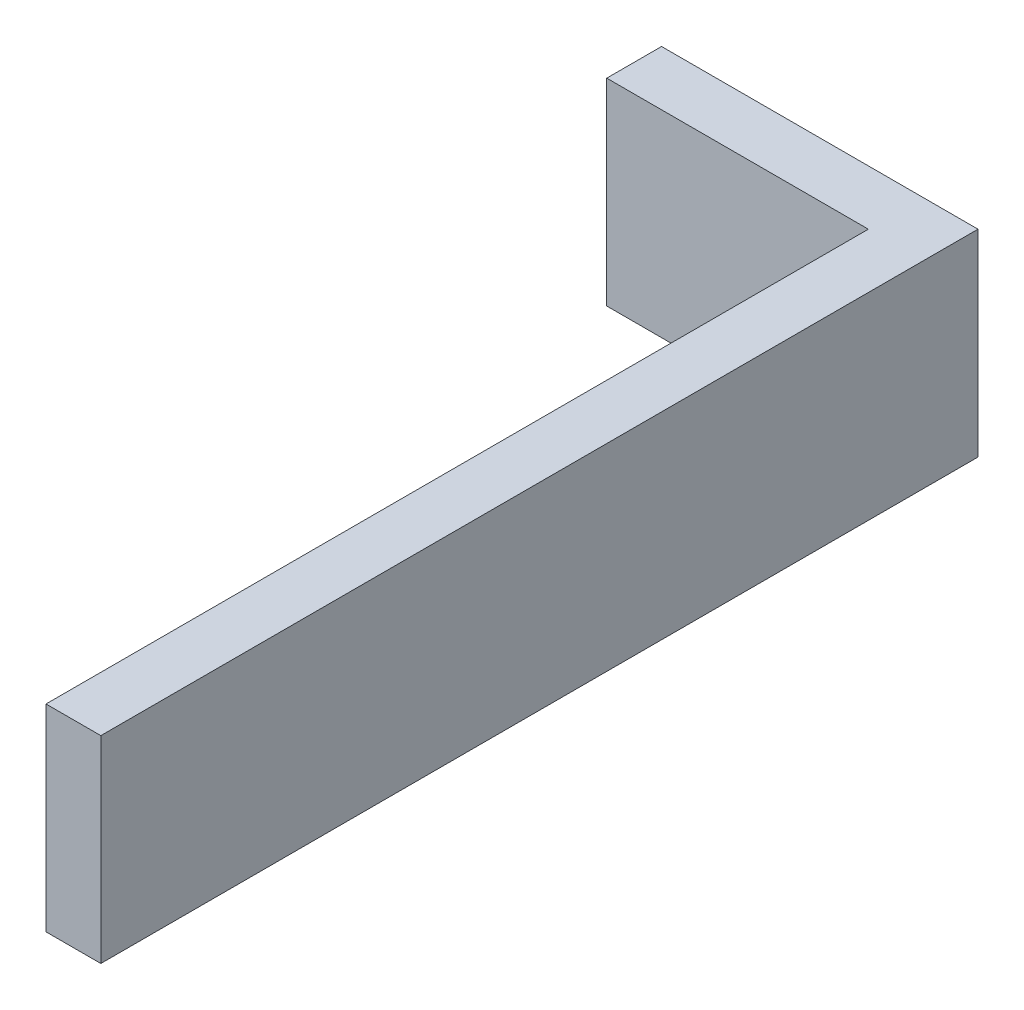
ISO-10303-21;
HEADER;
FILE_DESCRIPTION(('STEP AP214'),'2;1');
FILE_NAME('part.step','',(''),(''),'','','');
FILE_SCHEMA(('AUTOMOTIVE_DESIGN { 1 0 10303 214 1 1 1 1 }'));
ENDSEC;
DATA;
#1=APPLICATION_CONTEXT('core data for automotive mechanical design processes');
#2=APPLICATION_PROTOCOL_DEFINITION('international standard','automotive_design',2000,#1);
#3=PRODUCT_CONTEXT('',#1,'mechanical');
#4=PRODUCT('Part','Part','',(#3));
#5=PRODUCT_RELATED_PRODUCT_CATEGORY('part','',(#4));
#6=PRODUCT_DEFINITION_FORMATION('','',#4);
#7=PRODUCT_DEFINITION_CONTEXT('part definition',#1,'design');
#8=PRODUCT_DEFINITION('design','',#6,#7);
#9=PRODUCT_DEFINITION_SHAPE('','',#8);
#10=(LENGTH_UNIT() NAMED_UNIT(*) SI_UNIT(.MILLI.,.METRE.));
#11=(NAMED_UNIT(*) PLANE_ANGLE_UNIT() SI_UNIT($,.RADIAN.));
#12=(NAMED_UNIT(*) SI_UNIT($,.STERADIAN.) SOLID_ANGLE_UNIT());
#13=UNCERTAINTY_MEASURE_WITH_UNIT(LENGTH_MEASURE(1.E-05),#10,'distance_accuracy_value','');
#14=(GEOMETRIC_REPRESENTATION_CONTEXT(3) GLOBAL_UNCERTAINTY_ASSIGNED_CONTEXT((#13)) GLOBAL_UNIT_ASSIGNED_CONTEXT((#10,
#11,#12)) REPRESENTATION_CONTEXT('',''));
#15=CARTESIAN_POINT('',(0.,0.,0.));
#16=DIRECTION('',(0.,0.,1.));
#17=DIRECTION('',(1.,0.,0.));
#18=AXIS2_PLACEMENT_3D('',#15,#16,#17);
#19=CARTESIAN_POINT('',(-3.175,11.43,0.));
#20=DIRECTION('',(1.,0.,0.));
#21=DIRECTION('',(0.,0.,-1.));
#22=AXIS2_PLACEMENT_3D('',#19,#20,#21);
#23=PLANE('',#22);
#24=DIRECTION('',(0.,0.,1.));
#25=VECTOR('',#24,1.);
#26=CARTESIAN_POINT('',(-3.175,0.,0.));
#27=LINE('',#26,#25);
#28=CARTESIAN_POINT('',(-3.175,0.,3.175));
#29=VERTEX_POINT('',#28);
#30=CARTESIAN_POINT('',(-3.17499999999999,0.,50.8));
#31=VERTEX_POINT('',#30);
#32=EDGE_CURVE('E112',#29,#31,#27,.T.);
#33=ORIENTED_EDGE('',*,*,#32,.T.);
#34=DIRECTION('',(0.,-1.,0.));
#35=VECTOR('',#34,1.);
#36=CARTESIAN_POINT('',(-3.17499999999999,11.43,50.8));
#37=LINE('',#36,#35);
#38=CARTESIAN_POINT('',(-3.17499999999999,11.43,50.8));
#39=VERTEX_POINT('',#38);
#40=EDGE_CURVE('E11',#39,#31,#37,.T.);
#41=ORIENTED_EDGE('',*,*,#40,.F.);
#42=DIRECTION('',(0.,0.,1.));
#43=VECTOR('',#42,1.);
#44=CARTESIAN_POINT('',(-3.175,11.43,0.));
#45=LINE('',#44,#43);
#46=CARTESIAN_POINT('',(-3.175,11.43,3.175));
#47=VERTEX_POINT('',#46);
#48=EDGE_CURVE('E77',#47,#39,#45,.T.);
#49=ORIENTED_EDGE('',*,*,#48,.F.);
#50=DIRECTION('',(0.,-1.,0.));
#51=VECTOR('',#50,1.);
#52=CARTESIAN_POINT('',(-3.175,11.43,3.175));
#53=LINE('',#52,#51);
#54=EDGE_CURVE('E108',#47,#29,#53,.T.);
#55=ORIENTED_EDGE('',*,*,#54,.T.);
#56=EDGE_LOOP('',(#33,#41,#49,#55));
#57=FACE_BOUND('',#56,.T.);
#58=ADVANCED_FACE('F31',(#57),#23,.F.);
#59=CARTESIAN_POINT('',(0.,11.43,50.8));
#60=DIRECTION('',(0.,0.,1.));
#61=DIRECTION('',(1.,0.,0.));
#62=AXIS2_PLACEMENT_3D('',#59,#60,#61);
#63=PLANE('',#62);
#64=DIRECTION('',(-1.,0.,0.));
#65=VECTOR('',#64,1.);
#66=CARTESIAN_POINT('',(0.,0.,50.8));
#67=LINE('',#66,#65);
#68=CARTESIAN_POINT('',(0.,0.,50.8));
#69=VERTEX_POINT('',#68);
#70=EDGE_CURVE('E115',#69,#31,#67,.T.);
#71=ORIENTED_EDGE('',*,*,#70,.F.);
#72=DIRECTION('',(0.,-1.,0.));
#73=VECTOR('',#72,1.);
#74=CARTESIAN_POINT('',(0.,11.43,50.8));
#75=LINE('',#74,#73);
#76=CARTESIAN_POINT('',(0.,11.43,50.8));
#77=VERTEX_POINT('',#76);
#78=EDGE_CURVE('E39',#77,#69,#75,.T.);
#79=ORIENTED_EDGE('',*,*,#78,.F.);
#80=DIRECTION('',(-1.,0.,0.));
#81=VECTOR('',#80,1.);
#82=CARTESIAN_POINT('',(0.,11.43,50.8));
#83=LINE('',#82,#81);
#84=EDGE_CURVE('E201',#77,#39,#83,.T.);
#85=ORIENTED_EDGE('',*,*,#84,.T.);
#86=ORIENTED_EDGE('',*,*,#40,.T.);
#87=EDGE_LOOP('',(#71,#79,#85,#86));
#88=FACE_BOUND('',#87,.T.);
#89=ADVANCED_FACE('F133',(#88),#63,.T.);
#90=CARTESIAN_POINT('',(0.,11.43,0.));
#91=DIRECTION('',(1.,0.,0.));
#92=DIRECTION('',(0.,0.,-1.));
#93=AXIS2_PLACEMENT_3D('',#90,#91,#92);
#94=PLANE('',#93);
#95=DIRECTION('',(0.,0.,1.));
#96=VECTOR('',#95,1.);
#97=CARTESIAN_POINT('',(0.,0.,0.));
#98=LINE('',#97,#96);
#99=CARTESIAN_POINT('',(0.,0.,0.));
#100=VERTEX_POINT('',#99);
#101=EDGE_CURVE('E118',#100,#69,#98,.T.);
#102=ORIENTED_EDGE('',*,*,#101,.F.);
#103=DIRECTION('',(0.,-1.,0.));
#104=VECTOR('',#103,1.);
#105=CARTESIAN_POINT('',(0.,11.43,0.));
#106=LINE('',#105,#104);
#107=CARTESIAN_POINT('',(0.,11.43,0.));
#108=VERTEX_POINT('',#107);
#109=EDGE_CURVE('E98',#108,#100,#106,.T.);
#110=ORIENTED_EDGE('',*,*,#109,.F.);
#111=DIRECTION('',(0.,0.,1.));
#112=VECTOR('',#111,1.);
#113=CARTESIAN_POINT('',(0.,11.43,0.));
#114=LINE('',#113,#112);
#115=EDGE_CURVE('E104',#108,#77,#114,.T.);
#116=ORIENTED_EDGE('',*,*,#115,.T.);
#117=ORIENTED_EDGE('',*,*,#78,.T.);
#118=EDGE_LOOP('',(#102,#110,#116,#117));
#119=FACE_BOUND('',#118,.T.);
#120=ADVANCED_FACE('F130',(#119),#94,.T.);
#121=CARTESIAN_POINT('',(-18.3261,11.43,0.));
#122=DIRECTION('',(0.,0.,-1.));
#123=DIRECTION('',(-1.,0.,0.));
#124=AXIS2_PLACEMENT_3D('',#121,#122,#123);
#125=PLANE('',#124);
#126=DIRECTION('',(1.,0.,0.));
#127=VECTOR('',#126,1.);
#128=CARTESIAN_POINT('',(-18.3261,0.,0.));
#129=LINE('',#128,#127);
#130=CARTESIAN_POINT('',(-18.3261,0.,0.));
#131=VERTEX_POINT('',#130);
#132=EDGE_CURVE('E93',#131,#100,#129,.T.);
#133=ORIENTED_EDGE('',*,*,#132,.F.);
#134=DIRECTION('',(0.,-1.,0.));
#135=VECTOR('',#134,1.);
#136=CARTESIAN_POINT('',(-18.3261,11.43,0.));
#137=LINE('',#136,#135);
#138=CARTESIAN_POINT('',(-18.3261,11.43,0.));
#139=VERTEX_POINT('',#138);
#140=EDGE_CURVE('E88',#139,#131,#137,.T.);
#141=ORIENTED_EDGE('',*,*,#140,.F.);
#142=DIRECTION('',(1.,0.,0.));
#143=VECTOR('',#142,1.);
#144=CARTESIAN_POINT('',(-18.3261,11.43,0.));
#145=LINE('',#144,#143);
#146=EDGE_CURVE('E91',#139,#108,#145,.T.);
#147=ORIENTED_EDGE('',*,*,#146,.T.);
#148=ORIENTED_EDGE('',*,*,#109,.T.);
#149=EDGE_LOOP('',(#133,#141,#147,#148));
#150=FACE_BOUND('',#149,.T.);
#151=ADVANCED_FACE('F90',(#150),#125,.T.);
#152=CARTESIAN_POINT('',(-18.3261,11.43,3.175));
#153=DIRECTION('',(-1.,0.,0.));
#154=DIRECTION('',(0.,0.,1.));
#155=AXIS2_PLACEMENT_3D('',#152,#153,#154);
#156=PLANE('',#155);
#157=DIRECTION('',(0.,0.,-1.));
#158=VECTOR('',#157,1.);
#159=CARTESIAN_POINT('',(-18.3261,0.,3.175));
#160=LINE('',#159,#158);
#161=CARTESIAN_POINT('',(-18.3261,0.,3.175));
#162=VERTEX_POINT('',#161);
#163=EDGE_CURVE('E122',#162,#131,#160,.T.);
#164=ORIENTED_EDGE('',*,*,#163,.F.);
#165=DIRECTION('',(0.,-1.,0.));
#166=VECTOR('',#165,1.);
#167=CARTESIAN_POINT('',(-18.3261,11.43,3.175));
#168=LINE('',#167,#166);
#169=CARTESIAN_POINT('',(-18.3261,11.43,3.175));
#170=VERTEX_POINT('',#169);
#171=EDGE_CURVE('E68',#170,#162,#168,.T.);
#172=ORIENTED_EDGE('',*,*,#171,.F.);
#173=DIRECTION('',(0.,0.,-1.));
#174=VECTOR('',#173,1.);
#175=CARTESIAN_POINT('',(-18.3261,11.43,3.175));
#176=LINE('',#175,#174);
#177=EDGE_CURVE('E102',#170,#139,#176,.T.);
#178=ORIENTED_EDGE('',*,*,#177,.T.);
#179=ORIENTED_EDGE('',*,*,#140,.T.);
#180=EDGE_LOOP('',(#164,#172,#178,#179));
#181=FACE_BOUND('',#180,.T.);
#182=ADVANCED_FACE('F106',(#181),#156,.T.);
#183=CARTESIAN_POINT('',(-18.3261,11.43,3.175));
#184=DIRECTION('',(0.,0.,-1.));
#185=DIRECTION('',(-1.,0.,0.));
#186=AXIS2_PLACEMENT_3D('',#183,#184,#185);
#187=PLANE('',#186);
#188=DIRECTION('',(1.,0.,0.));
#189=VECTOR('',#188,1.);
#190=CARTESIAN_POINT('',(-18.3261,0.,3.175));
#191=LINE('',#190,#189);
#192=EDGE_CURVE('E71',#162,#29,#191,.T.);
#193=ORIENTED_EDGE('',*,*,#192,.T.);
#194=ORIENTED_EDGE('',*,*,#54,.F.);
#195=DIRECTION('',(1.,0.,0.));
#196=VECTOR('',#195,1.);
#197=CARTESIAN_POINT('',(-18.3261,11.43,3.175));
#198=LINE('',#197,#196);
#199=EDGE_CURVE('E47',#170,#47,#198,.T.);
#200=ORIENTED_EDGE('',*,*,#199,.F.);
#201=ORIENTED_EDGE('',*,*,#171,.T.);
#202=EDGE_LOOP('',(#193,#194,#200,#201));
#203=FACE_BOUND('',#202,.T.);
#204=ADVANCED_FACE('F138',(#203),#187,.F.);
#205=CARTESIAN_POINT('',(-3.17499999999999,11.43,50.8));
#206=DIRECTION('',(0.,-1.,0.));
#207=DIRECTION('',(-1.,0.,0.));
#208=AXIS2_PLACEMENT_3D('',#205,#206,#207);
#209=PLANE('',#208);
#210=ORIENTED_EDGE('',*,*,#48,.T.);
#211=ORIENTED_EDGE('',*,*,#84,.F.);
#212=ORIENTED_EDGE('',*,*,#115,.F.);
#213=ORIENTED_EDGE('',*,*,#146,.F.);
#214=ORIENTED_EDGE('',*,*,#177,.F.);
#215=ORIENTED_EDGE('',*,*,#199,.T.);
#216=EDGE_LOOP('',(#210,#211,#212,#213,#214,#215));
#217=FACE_BOUND('',#216,.T.);
#218=ADVANCED_FACE('F101',(#217),#209,.F.);
#219=CARTESIAN_POINT('',(-3.17499999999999,0.,50.8));
#220=DIRECTION('',(0.,-1.,0.));
#221=DIRECTION('',(-1.,0.,0.));
#222=AXIS2_PLACEMENT_3D('',#219,#220,#221);
#223=PLANE('',#222);
#224=ORIENTED_EDGE('',*,*,#32,.F.);
#225=ORIENTED_EDGE('',*,*,#192,.F.);
#226=ORIENTED_EDGE('',*,*,#163,.T.);
#227=ORIENTED_EDGE('',*,*,#132,.T.);
#228=ORIENTED_EDGE('',*,*,#101,.T.);
#229=ORIENTED_EDGE('',*,*,#70,.T.);
#230=EDGE_LOOP('',(#224,#225,#226,#227,#228,#229));
#231=FACE_BOUND('',#230,.T.);
#232=ADVANCED_FACE('F136',(#231),#223,.T.);
#233=CLOSED_SHELL('',(#58,#89,#120,#151,#182,#204,#218,#232));
#234=MANIFOLD_SOLID_BREP('B2',#233);
#235=ADVANCED_BREP_SHAPE_REPRESENTATION('',(#18,#234),#14);
#236=SHAPE_DEFINITION_REPRESENTATION(#9,#235);
ENDSEC;
END-ISO-10303-21;
